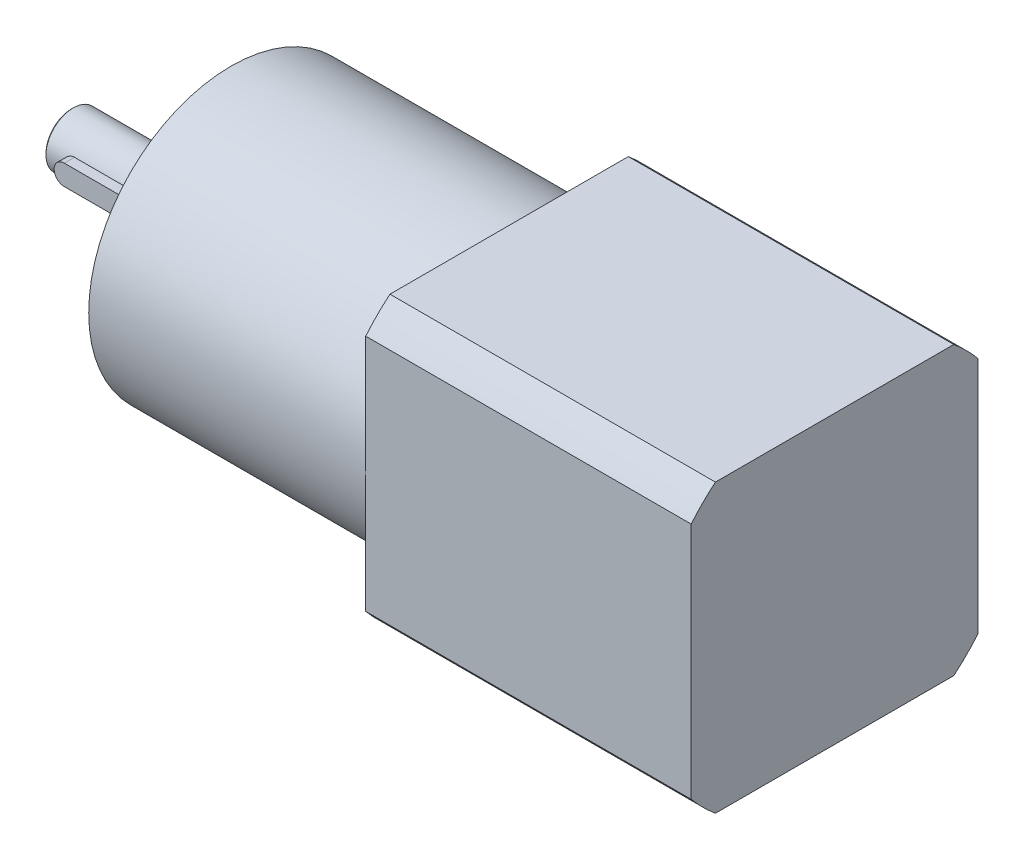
from build123d import *

# Parameters (mm, degrees)
ESQUISSE2_W                = 21.5
ESQUISSE2_H                = 4
BOSS_EXTRU_1_DEPTH         = 5.2
CHANFREIN1_SIZE            = 0.2
TROU_TARAUD_M41_AT_2_COUNT = 2
TROU_TARAUD_M41_AT_2_PITCH = 24.748737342
TROU_TARAUD_M41_AT_3_COUNT = 2
TROU_TARAUD_M41_AT_3_PITCH = 35
TROU_TARAUD_M41_AT_4_COUNT = 2
TROU_TARAUD_M41_AT_4_PITCH = 24.748737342
ESQUISSE6_OUTSIDE_W        = 84.354
ESQUISSE6_OUTSIDE_H        = 84.354
ESQUISSE6_OUTSIDE_W_2      = 42.3
ESQUISSE6_OUTSIDE_H_2      = 42.3
ENL_V_MAT_EXTRU_1_DEPTH    = 76.317660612


with BuildPart() as part:
    # Esquisse1 → R_volution1 (revolve)
    with BuildSketch(Plane.XY, mode=Mode.PRIVATE) as r_volution1_sk:
        Polygon((-2, 0), (-2, 12.5), (0, 12.5), (0, 21), (41, 21), (41, 27.5), (89, 27.5), (89, 0), align=None)
    revolve(r_volution1_sk.sketch.rotate(Axis((-41.073505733, 0, 0), (1, 0, 0)), 90), axis=Axis((-41.073505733, 0, 0), (1, 0, 0)))

    # Esquisse5 → Trou taraud_ M41 (revolve, cut)
    with BuildSketch(Plane(origin=(0, 0, -17.5), x_dir=(0, 0, 1), z_dir=(0, 1, 0))):
        Polygon((0, 0), (0, 11.091420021), (1.65, 10.1), (1.65, 0), align=None)
    trou_taraud_m41 = revolve(axis=Axis((-6.35, 0, -17.5), (1, 0, 0)), mode=Mode.SUBTRACT)

    # Trou taraud_ M41 at 2: Trou taraud_ M41 ×2
    with Locations(*[Vector(0, 0.7071067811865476, 0.7071067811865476) * (i * TROU_TARAUD_M41_AT_2_PITCH) for i in range(1, TROU_TARAUD_M41_AT_2_COUNT)]):
        add(trou_taraud_m41, mode=Mode.SUBTRACT)

    # Trou taraud_ M41 at 3: Trou taraud_ M41 ×2
    with Locations(*[(0, 0, i * TROU_TARAUD_M41_AT_3_PITCH) for i in range(1, TROU_TARAUD_M41_AT_3_COUNT)]):
        add(trou_taraud_m41, mode=Mode.SUBTRACT)

    # Trou taraud_ M41 at 4: Trou taraud_ M41 ×2
    with Locations(*[Vector(0, -0.7071067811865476, 0.7071067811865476) * (i * TROU_TARAUD_M41_AT_4_PITCH) for i in range(1, TROU_TARAUD_M41_AT_4_COUNT)]):
        add(trou_taraud_m41, mode=Mode.SUBTRACT)

    # Esquisse6 outside → Enl_v. mat.-Extru.1 (cut, through all)
    with BuildSketch(Plane.ZY.offset(-41)):
        Rectangle(ESQUISSE6_OUTSIDE_W, ESQUISSE6_OUTSIDE_H)
        Rectangle(ESQUISSE6_OUTSIDE_W_2, ESQUISSE6_OUTSIDE_H_2, mode=Mode.SUBTRACT)
    extrude(amount=-ENL_V_MAT_EXTRU_1_DEPTH, mode=Mode.SUBTRACT)


with BuildPart() as body_2:
    # Esquisse2 → R_volution2 (revolve)
    with BuildSketch(Plane.XY, mode=Mode.PRIVATE) as r_volution2_sk:
        with Locations((-12.75, 2)):
            Rectangle(ESQUISSE2_W, ESQUISSE2_H)
    revolve(r_volution2_sk.sketch.rotate(Axis((-41.224518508, 0, 0), (1, 0, 0)), 180), axis=Axis((-41.224518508, 0, 0), (1, 0, 0)))

    # Chanfrein1
    chanfrein1_edges = [body_2.edges().sort_by_distance(p)[0] for p in [
        (-23.5, 4, 0),
    ]]
    chamfer(chanfrein1_edges, length=CHANFREIN1_SIZE)


with BuildPart() as body_3:
    # Esquisse3 → Boss.-Extru.1 (new body)
    with BuildSketch(Plane.XY):
        with BuildLine():
            Line((-19.4, 1.5), (-8.4, 1.5))
            ThreePointArc((-8.4, 1.5), (-6.9, 0), (-8.4, -1.5))
            Line((-8.4, -1.5), (-19.4, -1.5))
            ThreePointArc((-19.4, -1.5), (-20.9, 0), (-19.4, 1.5))
        make_face()
    extrude(amount=BOSS_EXTRU_1_DEPTH)


solid = Compound([part.part, body_2.part, body_3.part])
